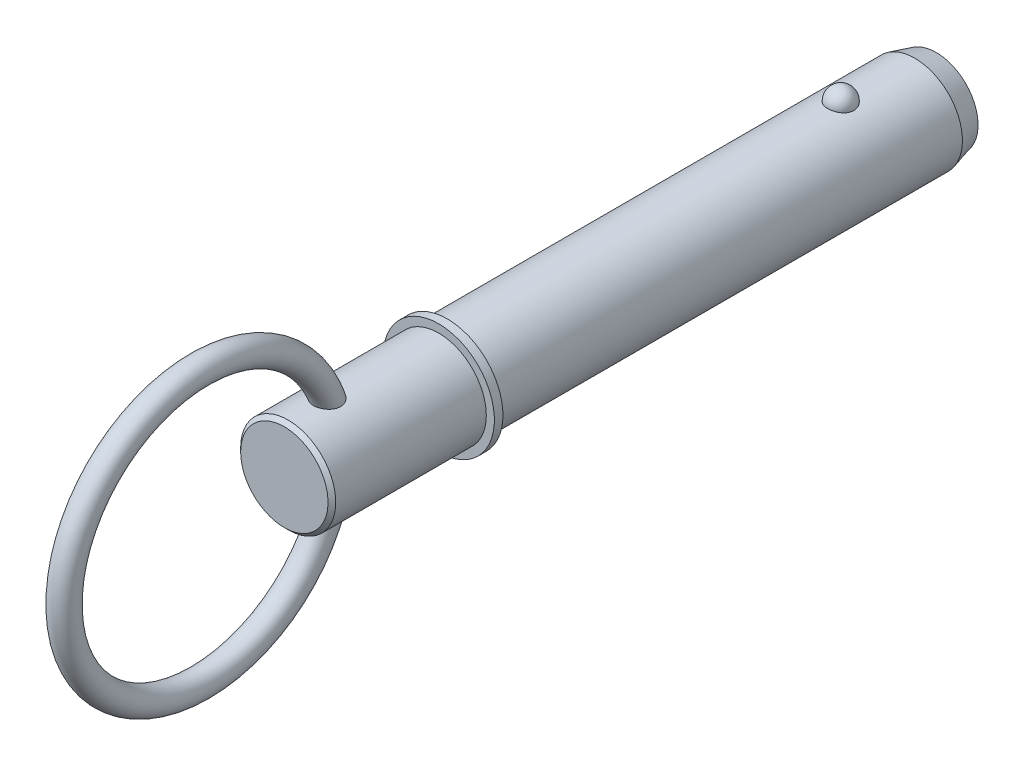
from build123d import *

# Parameters (mm, degrees)
SKETCH2_R           = 11.115
BOSS_EXTRUDE1_DEPTH = 88.9
BOSS_EXTRUDE2_START = 25.4
SKETCH3_R           = 11.115
BOSS_EXTRUDE2_DEPTH = 25.4
CHAMFER1_SIZE       = 5
CHAMFER1_SIZE2      = 1.339745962
SKETCH20_W          = 2
SKETCH20_H          = 13
SKETCH21_R          = 11.115
BOSS_EXTRUDE3_DEPTH = 38.1
CHAMFER2_SIZE       = 0.9
SKETCH24_R          = 3


with BuildPart() as part:
    # Sketch2 → Boss-Extrude1 (new body)
    with BuildSketch(Plane.XY):
        Circle(SKETCH2_R)
    extrude(amount=BOSS_EXTRUDE1_DEPTH)

    # Sketch3 → Boss-Extrude2 (add)
    with BuildSketch(Plane(origin=(0, 0, 0), x_dir=(-1, 0, 0), z_dir=(0, 0, -1)).offset(BOSS_EXTRUDE2_START)):
        Circle(SKETCH3_R)
    extrude(amount=-BOSS_EXTRUDE2_DEPTH)

    # Chamfer1
    chamfer1_edges = [part.edges().sort_by_distance(p)[0] for p in [
        (11.115, 0, -25.4),
    ]]
    chamfer1_side = [part.faces().sort_by_distance(p)[0] for p in [
        (11.115, 0, -12.7),
    ]]
    chamfer(chamfer1_edges, length=CHAMFER1_SIZE, length2=CHAMFER1_SIZE2, reference=chamfer1_side[0])

    # Sketch18 → Revolve1 (revolve)
    with BuildSketch(Plane(origin=(0, 0, 0), x_dir=(0, 0, -1), z_dir=(1, 0, 0))):
        with BuildLine():
            Line((3.07, 14.185), (3.07, 8.045))
            ThreePointArc((3.07, 8.045), (0, 11.115), (3.07, 14.185))
        make_face()
    revolve(axis=Axis((0, 14.185, -3.07), (0, -1, 0)))

    # Sketch20 → Revolve2 (revolve)
    with BuildSketch(Plane(origin=(0, 0, 0), x_dir=(0, 0, -1), z_dir=(1, 0, 0)), mode=Mode.PRIVATE) as revolve2_sk:
        with Locations((-89.9, 6.5)):
            Rectangle(SKETCH20_W, SKETCH20_H)
    revolve(revolve2_sk.sketch.rotate(Axis((0, 0, 33.728787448), (0, 0, 1)), 90), axis=Axis((0, 0, 33.728787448), (0, 0, 1)))

    # Sketch21 → Boss-Extrude3 (add)
    with BuildSketch(Plane(origin=(0, 0, 88.9), x_dir=(-1, 0, 0), z_dir=(0, 0, -1))):
        Circle(SKETCH21_R)
    extrude(amount=-BOSS_EXTRUDE3_DEPTH)

    # Chamfer2
    chamfer2_edges = [part.edges().sort_by_distance(p)[0] for p in [
        (11.115, 0, 127),
    ]]
    chamfer(chamfer2_edges, length=CHAMFER2_SIZE)

    # Sweep1: sweep along a path in Sketch23
    with BuildLine(Plane(origin=(0, 0, 0), x_dir=(0, 0, -1), z_dir=(1, 0, 0))) as sweep1_path:
        CenterArc((-146.75, 0), 31.75, 0, 360)
    # Sketch24 → Sweep1 (sweep)
    with BuildSketch(Plane(origin=(0, 0, 0), x_dir=(1, 0, 0), z_dir=(0, 1, 0))):
        with Locations((0, -115)):
            Circle(SKETCH24_R)
    sweep(path=sweep1_path.line)


solid = part.part
